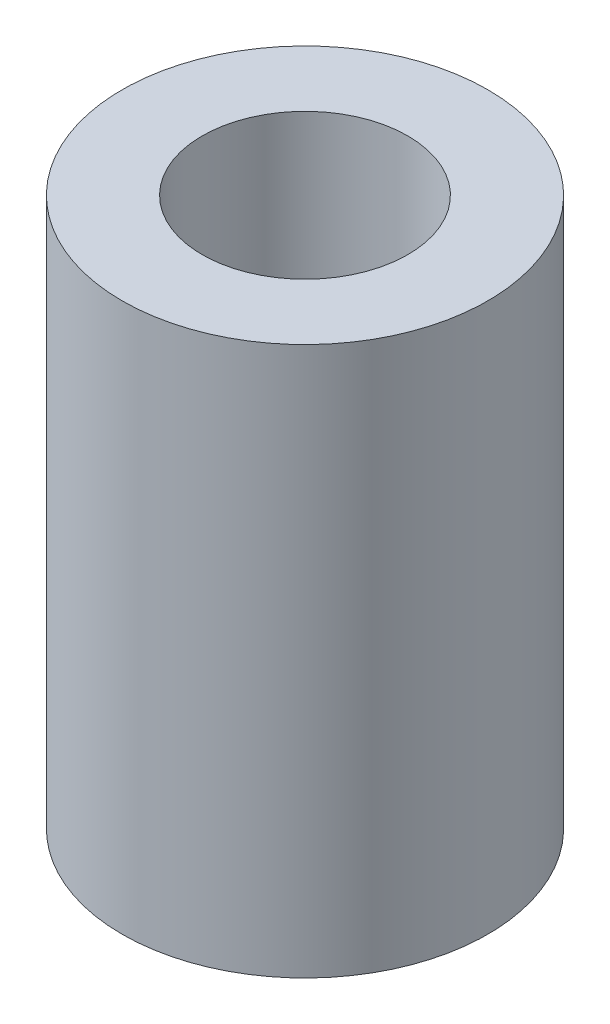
from build123d import *

# Parameters (mm, degrees)
SKETCH1_R           = 6.35
SKETCH1_R_2         = 3.571875
BOSS_EXTRUDE1_DEPTH = 19.05


with BuildPart() as part:
    # Sketch1 → Boss-Extrude1 (new body)
    with BuildSketch(Plane(origin=(0, 0, 0), x_dir=(1, 0, 0), z_dir=(0, 1, 0))):
        with Locations(Location((0, 0, 0), (0, 0, 90))):
            Circle(SKETCH1_R)
        with Locations(Location((0, 0, 0), (0, 0, 90))):
            Circle(SKETCH1_R_2, mode=Mode.SUBTRACT)
    extrude(amount=BOSS_EXTRUDE1_DEPTH)


solid = part.part
